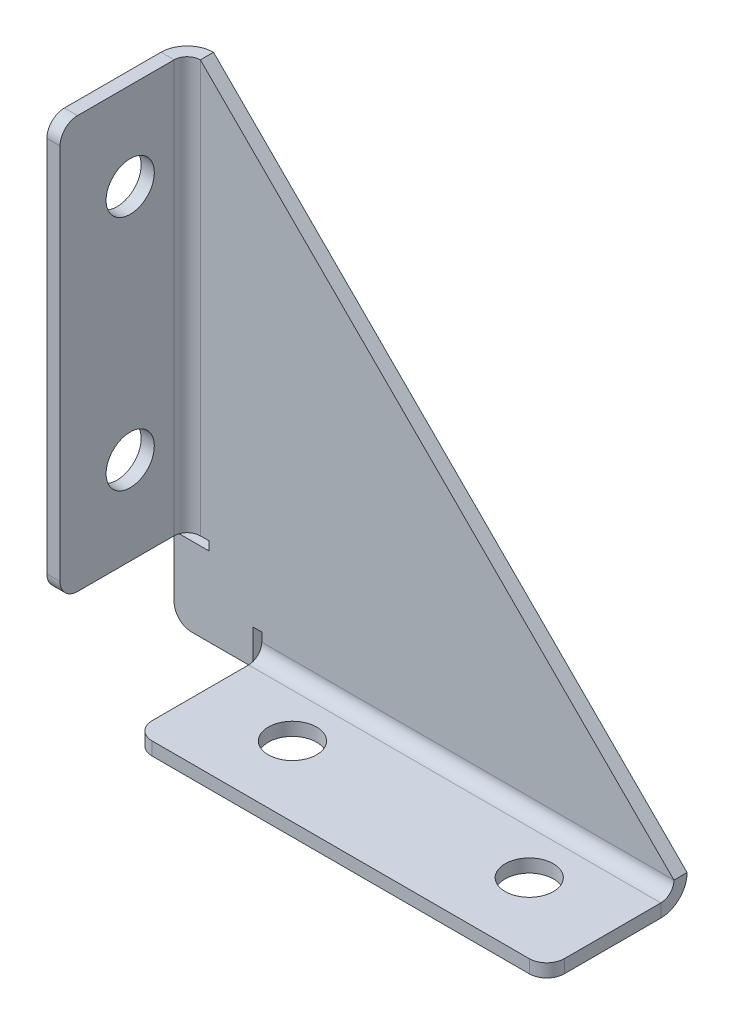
ISO-10303-21;
HEADER;
FILE_DESCRIPTION(('STEP AP214'),'2;1');
FILE_NAME('part.step','',(''),(''),'','','');
FILE_SCHEMA(('AUTOMOTIVE_DESIGN { 1 0 10303 214 1 1 1 1 }'));
ENDSEC;
DATA;
#1=APPLICATION_CONTEXT('core data for automotive mechanical design processes');
#2=APPLICATION_PROTOCOL_DEFINITION('international standard','automotive_design',2000,#1);
#3=PRODUCT_CONTEXT('',#1,'mechanical');
#4=PRODUCT('Part','Part','',(#3));
#5=PRODUCT_RELATED_PRODUCT_CATEGORY('part','',(#4));
#6=PRODUCT_DEFINITION_FORMATION('','',#4);
#7=PRODUCT_DEFINITION_CONTEXT('part definition',#1,'design');
#8=PRODUCT_DEFINITION('design','',#6,#7);
#9=PRODUCT_DEFINITION_SHAPE('','',#8);
#10=(LENGTH_UNIT() NAMED_UNIT(*) SI_UNIT(.MILLI.,.METRE.));
#11=(NAMED_UNIT(*) PLANE_ANGLE_UNIT() SI_UNIT($,.RADIAN.));
#12=(NAMED_UNIT(*) SI_UNIT($,.STERADIAN.) SOLID_ANGLE_UNIT());
#13=UNCERTAINTY_MEASURE_WITH_UNIT(LENGTH_MEASURE(1.E-05),#10,'distance_accuracy_value','');
#14=(GEOMETRIC_REPRESENTATION_CONTEXT(3) GLOBAL_UNCERTAINTY_ASSIGNED_CONTEXT((#13)) GLOBAL_UNIT_ASSIGNED_CONTEXT((#10,
#11,#12)) REPRESENTATION_CONTEXT('',''));
#15=CARTESIAN_POINT('',(0.,0.,0.));
#16=DIRECTION('',(0.,0.,1.));
#17=DIRECTION('',(1.,0.,0.));
#18=AXIS2_PLACEMENT_3D('',#15,#16,#17);
#19=CARTESIAN_POINT('',(47.,-1.80411241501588E-13,8.00000000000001));
#20=DIRECTION('',(0.,1.,0.));
#21=DIRECTION('',(0.,0.,1.));
#22=AXIS2_PLACEMENT_3D('',#19,#20,#21);
#23=CYLINDRICAL_SURFACE('',#22,2.75);
#24=CARTESIAN_POINT('',(47.,-1.80411241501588E-13,8.00000000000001));
#25=DIRECTION('',(0.,1.,0.));
#26=DIRECTION('',(0.,0.,1.));
#27=AXIS2_PLACEMENT_3D('',#24,#25,#26);
#28=CIRCLE('',#27,2.75);
#29=CARTESIAN_POINT('',(47.,-1.79636973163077E-13,10.75));
#30=VERTEX_POINT('',#29);
#31=EDGE_CURVE('E265',#30,#30,#28,.T.);
#32=ORIENTED_EDGE('',*,*,#31,.F.);
#33=EDGE_LOOP('',(#32));
#34=FACE_BOUND('',#33,.T.);
#35=CARTESIAN_POINT('',(47.,1.49999999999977,8.00000000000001));
#36=DIRECTION('',(0.,1.,0.));
#37=DIRECTION('',(0.,0.,1.));
#38=AXIS2_PLACEMENT_3D('',#35,#36,#37);
#39=CIRCLE('',#38,2.75);
#40=CARTESIAN_POINT('',(47.,1.49999999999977,10.75));
#41=VERTEX_POINT('',#40);
#42=EDGE_CURVE('E257',#41,#41,#39,.T.);
#43=ORIENTED_EDGE('',*,*,#42,.T.);
#44=EDGE_LOOP('',(#43));
#45=FACE_BOUND('',#44,.T.);
#46=ADVANCED_FACE('F28',(#34,#45),#23,.F.);
#47=CARTESIAN_POINT('',(0.,0.,1.50000000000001));
#48=DIRECTION('',(0.,1.,0.));
#49=DIRECTION('',(0.,0.,1.));
#50=AXIS2_PLACEMENT_3D('',#47,#48,#49);
#51=PLANE('',#50);
#52=CARTESIAN_POINT('',(20.,0.,8.00000000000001));
#53=DIRECTION('',(0.,1.,0.));
#54=DIRECTION('',(0.,0.,1.));
#55=AXIS2_PLACEMENT_3D('',#52,#53,#54);
#56=CIRCLE('',#55,2.75);
#57=CARTESIAN_POINT('',(20.,0.,10.75));
#58=VERTEX_POINT('',#57);
#59=EDGE_CURVE('E262',#58,#58,#56,.T.);
#60=ORIENTED_EDGE('',*,*,#59,.T.);
#61=EDGE_LOOP('',(#60));
#62=FACE_BOUND('',#61,.T.);
#63=ORIENTED_EDGE('',*,*,#31,.T.);
#64=EDGE_LOOP('',(#63));
#65=FACE_BOUND('',#64,.T.);
#66=DIRECTION('',(0.,0.,-1.));
#67=VECTOR('',#66,1.);
#68=CARTESIAN_POINT('',(10.,0.,16.));
#69=LINE('',#68,#67);
#70=CARTESIAN_POINT('',(10.,0.,14.));
#71=VERTEX_POINT('',#70);
#72=CARTESIAN_POINT('',(10.,0.,3.));
#73=VERTEX_POINT('',#72);
#74=EDGE_CURVE('E223',#71,#73,#69,.T.);
#75=ORIENTED_EDGE('',*,*,#74,.T.);
#76=DIRECTION('',(1.,0.,0.));
#77=VECTOR('',#76,1.);
#78=CARTESIAN_POINT('',(10.,0.,3.));
#79=LINE('',#78,#77);
#80=CARTESIAN_POINT('',(56.9999999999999,-1.90819582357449E-13,3.));
#81=VERTEX_POINT('',#80);
#82=EDGE_CURVE('E222',#73,#81,#79,.T.);
#83=ORIENTED_EDGE('',*,*,#82,.T.);
#84=DIRECTION('',(0.,0.,-1.));
#85=VECTOR('',#84,1.);
#86=CARTESIAN_POINT('',(57.,-1.90819582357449E-13,16.));
#87=LINE('',#86,#85);
#88=CARTESIAN_POINT('',(57.,-1.90819582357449E-13,14.));
#89=VERTEX_POINT('',#88);
#90=EDGE_CURVE('E11',#89,#81,#87,.T.);
#91=ORIENTED_EDGE('',*,*,#90,.F.);
#92=CARTESIAN_POINT('',(55.,-1.80411241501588E-13,14.));
#93=DIRECTION('',(0.,1.,0.));
#94=DIRECTION('',(0.,0.,1.));
#95=AXIS2_PLACEMENT_3D('',#92,#93,#94);
#96=CIRCLE('',#95,2.);
#97=CARTESIAN_POINT('',(55.,-1.80411241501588E-13,16.));
#98=VERTEX_POINT('',#97);
#99=EDGE_CURVE('E248',#89,#98,#96,.F.);
#100=ORIENTED_EDGE('',*,*,#99,.T.);
#101=DIRECTION('',(-1.,0.,0.));
#102=VECTOR('',#101,1.);
#103=CARTESIAN_POINT('',(57.,-1.90819582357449E-13,16.));
#104=LINE('',#103,#102);
#105=CARTESIAN_POINT('',(12.,0.,16.));
#106=VERTEX_POINT('',#105);
#107=EDGE_CURVE('E245',#98,#106,#104,.T.);
#108=ORIENTED_EDGE('',*,*,#107,.T.);
#109=CARTESIAN_POINT('',(12.,0.,14.));
#110=DIRECTION('',(0.,1.,0.));
#111=DIRECTION('',(0.,0.,1.));
#112=AXIS2_PLACEMENT_3D('',#109,#110,#111);
#113=CIRCLE('',#112,2.);
#114=EDGE_CURVE('E229',#106,#71,#113,.F.);
#115=ORIENTED_EDGE('',*,*,#114,.T.);
#116=EDGE_LOOP('',(#75,#83,#91,#100,#108,#115));
#117=FACE_BOUND('',#116,.T.);
#118=ADVANCED_FACE('F268',(#62,#65,#117),#51,.F.);
#119=CARTESIAN_POINT('',(20.,0.,8.00000000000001));
#120=DIRECTION('',(0.,1.,0.));
#121=DIRECTION('',(0.,0.,1.));
#122=AXIS2_PLACEMENT_3D('',#119,#120,#121);
#123=CYLINDRICAL_SURFACE('',#122,2.75);
#124=ORIENTED_EDGE('',*,*,#59,.F.);
#125=EDGE_LOOP('',(#124));
#126=FACE_BOUND('',#125,.T.);
#127=CARTESIAN_POINT('',(20.,1.49999999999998,8.00000000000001));
#128=DIRECTION('',(0.,1.,0.));
#129=DIRECTION('',(0.,0.,1.));
#130=AXIS2_PLACEMENT_3D('',#127,#128,#129);
#131=CIRCLE('',#130,2.75);
#132=CARTESIAN_POINT('',(20.,1.49999999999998,10.75));
#133=VERTEX_POINT('',#132);
#134=EDGE_CURVE('E463',#133,#133,#131,.T.);
#135=ORIENTED_EDGE('',*,*,#134,.T.);
#136=EDGE_LOOP('',(#135));
#137=FACE_BOUND('',#136,.T.);
#138=ADVANCED_FACE('F470',(#126,#137),#123,.F.);
#139=CARTESIAN_POINT('',(10.,1.49999999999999,16.));
#140=DIRECTION('',(0.,1.,0.));
#141=DIRECTION('',(0.,0.,1.));
#142=AXIS2_PLACEMENT_3D('',#139,#140,#141);
#143=PLANE('',#142);
#144=DIRECTION('',(1.,0.,0.));
#145=VECTOR('',#144,1.);
#146=CARTESIAN_POINT('',(10.,1.49999999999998,3.));
#147=LINE('',#146,#145);
#148=CARTESIAN_POINT('',(10.,1.49999999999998,3.));
#149=VERTEX_POINT('',#148);
#150=CARTESIAN_POINT('',(56.9999999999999,1.49999999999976,3.00000000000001));
#151=VERTEX_POINT('',#150);
#152=EDGE_CURVE('E206',#149,#151,#147,.T.);
#153=ORIENTED_EDGE('',*,*,#152,.F.);
#154=DIRECTION('',(0.,0.,-1.));
#155=VECTOR('',#154,1.);
#156=CARTESIAN_POINT('',(10.,1.49999999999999,16.));
#157=LINE('',#156,#155);
#158=CARTESIAN_POINT('',(10.,1.49999999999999,14.));
#159=VERTEX_POINT('',#158);
#160=EDGE_CURVE('E214',#159,#149,#157,.T.);
#161=ORIENTED_EDGE('',*,*,#160,.F.);
#162=CARTESIAN_POINT('',(12.,1.49999999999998,14.));
#163=DIRECTION('',(0.,1.,0.));
#164=DIRECTION('',(0.,0.,1.));
#165=AXIS2_PLACEMENT_3D('',#162,#163,#164);
#166=CIRCLE('',#165,2.);
#167=CARTESIAN_POINT('',(12.,1.49999999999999,16.));
#168=VERTEX_POINT('',#167);
#169=EDGE_CURVE('E43',#159,#168,#166,.T.);
#170=ORIENTED_EDGE('',*,*,#169,.T.);
#171=DIRECTION('',(1.,0.,0.));
#172=VECTOR('',#171,1.);
#173=CARTESIAN_POINT('',(10.,1.49999999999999,16.));
#174=LINE('',#173,#172);
#175=CARTESIAN_POINT('',(55.,1.49999999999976,16.));
#176=VERTEX_POINT('',#175);
#177=EDGE_CURVE('E51',#168,#176,#174,.T.);
#178=ORIENTED_EDGE('',*,*,#177,.T.);
#179=CARTESIAN_POINT('',(55.,1.49999999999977,14.));
#180=DIRECTION('',(0.,1.,0.));
#181=DIRECTION('',(0.,0.,1.));
#182=AXIS2_PLACEMENT_3D('',#179,#180,#181);
#183=CIRCLE('',#182,2.);
#184=CARTESIAN_POINT('',(57.,1.49999999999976,14.));
#185=VERTEX_POINT('',#184);
#186=EDGE_CURVE('E254',#176,#185,#183,.T.);
#187=ORIENTED_EDGE('',*,*,#186,.T.);
#188=DIRECTION('',(0.,0.,-1.));
#189=VECTOR('',#188,1.);
#190=CARTESIAN_POINT('',(57.,1.49999999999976,16.));
#191=LINE('',#190,#189);
#192=EDGE_CURVE('E216',#185,#151,#191,.T.);
#193=ORIENTED_EDGE('',*,*,#192,.T.);
#194=EDGE_LOOP('',(#153,#161,#170,#178,#187,#193));
#195=FACE_BOUND('',#194,.T.);
#196=ORIENTED_EDGE('',*,*,#134,.F.);
#197=EDGE_LOOP('',(#196));
#198=FACE_BOUND('',#197,.T.);
#199=ORIENTED_EDGE('',*,*,#42,.F.);
#200=EDGE_LOOP('',(#199));
#201=FACE_BOUND('',#200,.T.);
#202=ADVANCED_FACE('F219',(#195,#198,#201),#143,.T.);
#203=CARTESIAN_POINT('',(9.99999999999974,97.529482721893,16.));
#204=DIRECTION('',(-1.,0.,0.));
#205=DIRECTION('',(0.,1.,0.));
#206=AXIS2_PLACEMENT_3D('',#203,#204,#205);
#207=PLANE('',#206);
#208=ORIENTED_EDGE('',*,*,#74,.F.);
#209=DIRECTION('',(0.,-1.,0.));
#210=VECTOR('',#209,1.);
#211=CARTESIAN_POINT('',(9.99999999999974,97.529482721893,14.));
#212=LINE('',#211,#210);
#213=EDGE_CURVE('E201',#159,#71,#212,.T.);
#214=ORIENTED_EDGE('',*,*,#213,.F.);
#215=ORIENTED_EDGE('',*,*,#160,.T.);
#216=DIRECTION('',(0.,-1.,0.));
#217=VECTOR('',#216,1.);
#218=CARTESIAN_POINT('',(9.99999999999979,97.5294827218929,3.00000000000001));
#219=LINE('',#218,#217);
#220=EDGE_CURVE('E36',#149,#73,#219,.T.);
#221=ORIENTED_EDGE('',*,*,#220,.T.);
#222=EDGE_LOOP('',(#208,#214,#215,#221));
#223=FACE_BOUND('',#222,.T.);
#224=ADVANCED_FACE('F30',(#223),#207,.T.);
#225=CARTESIAN_POINT('',(11.9999999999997,97.529482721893,14.));
#226=DIRECTION('',(0.,-1.,0.));
#227=DIRECTION('',(0.,0.,-1.));
#228=AXIS2_PLACEMENT_3D('',#225,#226,#227);
#229=CYLINDRICAL_SURFACE('',#228,2.);
#230=ORIENTED_EDGE('',*,*,#213,.T.);
#231=ORIENTED_EDGE('',*,*,#114,.F.);
#232=DIRECTION('',(0.,-1.,0.));
#233=VECTOR('',#232,1.);
#234=CARTESIAN_POINT('',(11.9999999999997,97.529482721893,16.));
#235=LINE('',#234,#233);
#236=EDGE_CURVE('E240',#168,#106,#235,.T.);
#237=ORIENTED_EDGE('',*,*,#236,.F.);
#238=ORIENTED_EDGE('',*,*,#169,.F.);
#239=EDGE_LOOP('',(#230,#231,#237,#238));
#240=FACE_BOUND('',#239,.T.);
#241=ADVANCED_FACE('F243',(#240),#229,.T.);
#242=CARTESIAN_POINT('',(9.99999999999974,97.529482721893,16.));
#243=DIRECTION('',(0.,0.,-1.));
#244=DIRECTION('',(0.,1.,0.));
#245=AXIS2_PLACEMENT_3D('',#242,#243,#244);
#246=PLANE('',#245);
#247=ORIENTED_EDGE('',*,*,#236,.T.);
#248=ORIENTED_EDGE('',*,*,#107,.F.);
#249=DIRECTION('',(0.,-1.,0.));
#250=VECTOR('',#249,1.);
#251=CARTESIAN_POINT('',(54.9999999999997,97.5294827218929,16.));
#252=LINE('',#251,#250);
#253=EDGE_CURVE('E237',#176,#98,#252,.T.);
#254=ORIENTED_EDGE('',*,*,#253,.F.);
#255=ORIENTED_EDGE('',*,*,#177,.F.);
#256=EDGE_LOOP('',(#247,#248,#254,#255));
#257=FACE_BOUND('',#256,.T.);
#258=ADVANCED_FACE('F247',(#257),#246,.F.);
#259=CARTESIAN_POINT('',(54.9999999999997,97.5294827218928,14.));
#260=DIRECTION('',(0.,-1.,0.));
#261=DIRECTION('',(0.,0.,-1.));
#262=AXIS2_PLACEMENT_3D('',#259,#260,#261);
#263=CYLINDRICAL_SURFACE('',#262,2.);
#264=ORIENTED_EDGE('',*,*,#253,.T.);
#265=ORIENTED_EDGE('',*,*,#99,.F.);
#266=DIRECTION('',(0.,-1.,0.));
#267=VECTOR('',#266,1.);
#268=CARTESIAN_POINT('',(56.9999999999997,97.5294827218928,14.));
#269=LINE('',#268,#267);
#270=EDGE_CURVE('E234',#185,#89,#269,.T.);
#271=ORIENTED_EDGE('',*,*,#270,.F.);
#272=ORIENTED_EDGE('',*,*,#186,.F.);
#273=EDGE_LOOP('',(#264,#265,#271,#272));
#274=FACE_BOUND('',#273,.T.);
#275=ADVANCED_FACE('F252',(#274),#263,.T.);
#276=CARTESIAN_POINT('',(56.9999999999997,97.5294827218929,16.));
#277=DIRECTION('',(-1.,0.,0.));
#278=DIRECTION('',(0.,1.,0.));
#279=AXIS2_PLACEMENT_3D('',#276,#277,#278);
#280=PLANE('',#279);
#281=ORIENTED_EDGE('',*,*,#270,.T.);
#282=ORIENTED_EDGE('',*,*,#90,.T.);
#283=DIRECTION('',(0.,-1.,0.));
#284=VECTOR('',#283,1.);
#285=CARTESIAN_POINT('',(56.9999999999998,97.5294827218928,3.00000000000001));
#286=LINE('',#285,#284);
#287=EDGE_CURVE('E226',#151,#81,#286,.T.);
#288=ORIENTED_EDGE('',*,*,#287,.F.);
#289=ORIENTED_EDGE('',*,*,#192,.F.);
#290=EDGE_LOOP('',(#281,#282,#288,#289));
#291=FACE_BOUND('',#290,.T.);
#292=ADVANCED_FACE('F271',(#291),#280,.F.);
#293=CARTESIAN_POINT('',(-5.00000001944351E-05,47.,8.00000000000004));
#294=DIRECTION('',(1.,0.,0.));
#295=DIRECTION('',(0.,0.,-1.));
#296=AXIS2_PLACEMENT_3D('',#293,#294,#295);
#297=CYLINDRICAL_SURFACE('',#296,2.75);
#298=CARTESIAN_POINT('',(1.49999999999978,47.,8.00000000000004));
#299=DIRECTION('',(1.,0.,0.));
#300=DIRECTION('',(0.,0.,-1.));
#301=AXIS2_PLACEMENT_3D('',#298,#299,#300);
#302=CIRCLE('',#301,2.75);
#303=CARTESIAN_POINT('',(1.49999999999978,47.,5.25000000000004));
#304=VERTEX_POINT('',#303);
#305=EDGE_CURVE('E401',#304,#304,#302,.T.);
#306=ORIENTED_EDGE('',*,*,#305,.T.);
#307=EDGE_LOOP('',(#306));
#308=FACE_BOUND('',#307,.T.);
#309=CARTESIAN_POINT('',(-2.20752932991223E-13,47.,8.00000000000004));
#310=DIRECTION('',(1.,0.,0.));
#311=DIRECTION('',(0.,1.,0.));
#312=AXIS2_PLACEMENT_3D('',#309,#310,#311);
#313=CIRCLE('',#312,2.75);
#314=CARTESIAN_POINT('',(-2.27895279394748E-13,49.75,8.00000000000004));
#315=VERTEX_POINT('',#314);
#316=EDGE_CURVE('E420',#315,#315,#313,.T.);
#317=ORIENTED_EDGE('',*,*,#316,.F.);
#318=EDGE_LOOP('',(#317));
#319=FACE_BOUND('',#318,.T.);
#320=ADVANCED_FACE('F490',(#308,#319),#297,.F.);
#321=CARTESIAN_POINT('',(-2.20381677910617E-13,60.,1.49999999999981));
#322=DIRECTION('',(1.,0.,0.));
#323=DIRECTION('',(0.,1.,0.));
#324=AXIS2_PLACEMENT_3D('',#321,#322,#323);
#325=PLANE('',#324);
#326=CARTESIAN_POINT('',(0.,20.,8.00000000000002));
#327=DIRECTION('',(1.,0.,0.));
#328=DIRECTION('',(0.,1.,0.));
#329=AXIS2_PLACEMENT_3D('',#326,#327,#328);
#330=CIRCLE('',#329,2.75);
#331=CARTESIAN_POINT('',(0.,22.75,8.00000000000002));
#332=VERTEX_POINT('',#331);
#333=EDGE_CURVE('E417',#332,#332,#330,.T.);
#334=ORIENTED_EDGE('',*,*,#333,.T.);
#335=EDGE_LOOP('',(#334));
#336=FACE_BOUND('',#335,.T.);
#337=ORIENTED_EDGE('',*,*,#316,.T.);
#338=EDGE_LOOP('',(#337));
#339=FACE_BOUND('',#338,.T.);
#340=DIRECTION('',(0.,0.,-1.));
#341=VECTOR('',#340,1.);
#342=CARTESIAN_POINT('',(-2.20488217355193E-13,57.,15.9999999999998));
#343=LINE('',#342,#341);
#344=CARTESIAN_POINT('',(-2.20485007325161E-13,57.,13.9999999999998));
#345=VERTEX_POINT('',#344);
#346=CARTESIAN_POINT('',(-2.20467352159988E-13,57.,2.9999999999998));
#347=VERTEX_POINT('',#346);
#348=EDGE_CURVE('E435',#345,#347,#343,.T.);
#349=ORIENTED_EDGE('',*,*,#348,.T.);
#350=DIRECTION('',(0.,-1.,0.));
#351=VECTOR('',#350,1.);
#352=CARTESIAN_POINT('',(-2.20467352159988E-13,57.,2.9999999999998));
#353=LINE('',#352,#351);
#354=CARTESIAN_POINT('',(0.,10.,3.00000000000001));
#355=VERTEX_POINT('',#354);
#356=EDGE_CURVE('E443',#347,#355,#353,.T.);
#357=ORIENTED_EDGE('',*,*,#356,.T.);
#358=DIRECTION('',(0.,0.,-1.));
#359=VECTOR('',#358,1.);
#360=CARTESIAN_POINT('',(0.,10.,16.));
#361=LINE('',#360,#359);
#362=CARTESIAN_POINT('',(0.,10.,14.));
#363=VERTEX_POINT('',#362);
#364=EDGE_CURVE('E423',#363,#355,#361,.T.);
#365=ORIENTED_EDGE('',*,*,#364,.F.);
#366=CARTESIAN_POINT('',(0.,12.,14.));
#367=DIRECTION('',(1.,0.,0.));
#368=DIRECTION('',(0.,1.,0.));
#369=AXIS2_PLACEMENT_3D('',#366,#367,#368);
#370=CIRCLE('',#369,2.);
#371=CARTESIAN_POINT('',(0.,12.,16.));
#372=VERTEX_POINT('',#371);
#373=EDGE_CURVE('E426',#363,#372,#370,.F.);
#374=ORIENTED_EDGE('',*,*,#373,.T.);
#375=DIRECTION('',(0.,-1.,0.));
#376=VECTOR('',#375,1.);
#377=CARTESIAN_POINT('',(-2.20488217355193E-13,57.,15.9999999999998));
#378=LINE('',#377,#376);
#379=CARTESIAN_POINT('',(-2.20543728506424E-13,55.,15.9999999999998));
#380=VERTEX_POINT('',#379);
#381=EDGE_CURVE('E430',#380,#372,#378,.T.);
#382=ORIENTED_EDGE('',*,*,#381,.F.);
#383=CARTESIAN_POINT('',(-2.20540518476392E-13,55.,13.9999999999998));
#384=DIRECTION('',(1.,0.,0.));
#385=DIRECTION('',(0.,1.,0.));
#386=AXIS2_PLACEMENT_3D('',#383,#384,#385);
#387=CIRCLE('',#386,2.);
#388=EDGE_CURVE('E433',#380,#345,#387,.F.);
#389=ORIENTED_EDGE('',*,*,#388,.T.);
#390=EDGE_LOOP('',(#349,#357,#365,#374,#382,#389));
#391=FACE_BOUND('',#390,.T.);
#392=ADVANCED_FACE('F520',(#336,#339,#391),#325,.F.);
#393=CARTESIAN_POINT('',(-4.99999999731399E-05,20.,8.00000000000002));
#394=DIRECTION('',(1.,0.,0.));
#395=DIRECTION('',(0.,0.,-1.));
#396=AXIS2_PLACEMENT_3D('',#393,#394,#395);
#397=CYLINDRICAL_SURFACE('',#396,2.75);
#398=CARTESIAN_POINT('',(1.5,20.,8.00000000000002));
#399=DIRECTION('',(1.,0.,0.));
#400=DIRECTION('',(0.,0.,-1.));
#401=AXIS2_PLACEMENT_3D('',#398,#399,#400);
#402=CIRCLE('',#401,2.75);
#403=CARTESIAN_POINT('',(1.5,20.,5.25000000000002));
#404=VERTEX_POINT('',#403);
#405=EDGE_CURVE('E398',#404,#404,#402,.T.);
#406=ORIENTED_EDGE('',*,*,#405,.T.);
#407=EDGE_LOOP('',(#406));
#408=FACE_BOUND('',#407,.T.);
#409=ORIENTED_EDGE('',*,*,#333,.F.);
#410=EDGE_LOOP('',(#409));
#411=FACE_BOUND('',#410,.T.);
#412=ADVANCED_FACE('F529',(#408,#411),#397,.F.);
#413=CARTESIAN_POINT('',(1.5,10.,16.));
#414=DIRECTION('',(-1.,0.,0.));
#415=DIRECTION('',(0.,0.,1.));
#416=AXIS2_PLACEMENT_3D('',#413,#414,#415);
#417=PLANE('',#416);
#418=ORIENTED_EDGE('',*,*,#405,.F.);
#419=EDGE_LOOP('',(#418));
#420=FACE_BOUND('',#419,.T.);
#421=ORIENTED_EDGE('',*,*,#305,.F.);
#422=EDGE_LOOP('',(#421));
#423=FACE_BOUND('',#422,.T.);
#424=DIRECTION('',(0.,0.,-1.));
#425=VECTOR('',#424,1.);
#426=CARTESIAN_POINT('',(1.5,10.,16.));
#427=LINE('',#426,#425);
#428=CARTESIAN_POINT('',(1.5,10.,14.));
#429=VERTEX_POINT('',#428);
#430=CARTESIAN_POINT('',(1.5,10.,3.00000000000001));
#431=VERTEX_POINT('',#430);
#432=EDGE_CURVE('E409',#429,#431,#427,.T.);
#433=ORIENTED_EDGE('',*,*,#432,.T.);
#434=DIRECTION('',(0.,1.,0.));
#435=VECTOR('',#434,1.);
#436=CARTESIAN_POINT('',(1.49999999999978,57.,2.9999999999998));
#437=LINE('',#436,#435);
#438=CARTESIAN_POINT('',(1.49999999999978,57.,2.9999999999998));
#439=VERTEX_POINT('',#438);
#440=EDGE_CURVE('E438',#431,#439,#437,.T.);
#441=ORIENTED_EDGE('',*,*,#440,.T.);
#442=DIRECTION('',(0.,0.,-1.));
#443=VECTOR('',#442,1.);
#444=CARTESIAN_POINT('',(1.49999999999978,57.,15.9999999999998));
#445=LINE('',#444,#443);
#446=CARTESIAN_POINT('',(1.49999999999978,57.,13.9999999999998));
#447=VERTEX_POINT('',#446);
#448=EDGE_CURVE('E412',#447,#439,#445,.T.);
#449=ORIENTED_EDGE('',*,*,#448,.F.);
#450=CARTESIAN_POINT('',(1.49999999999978,55.,13.9999999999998));
#451=DIRECTION('',(-1.,0.,0.));
#452=DIRECTION('',(0.,0.,1.));
#453=AXIS2_PLACEMENT_3D('',#450,#451,#452);
#454=CIRCLE('',#453,2.);
#455=CARTESIAN_POINT('',(1.49999999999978,55.,15.9999999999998));
#456=VERTEX_POINT('',#455);
#457=EDGE_CURVE('E415',#447,#456,#454,.F.);
#458=ORIENTED_EDGE('',*,*,#457,.T.);
#459=DIRECTION('',(0.,1.,0.));
#460=VECTOR('',#459,1.);
#461=CARTESIAN_POINT('',(1.5,10.,16.));
#462=LINE('',#461,#460);
#463=CARTESIAN_POINT('',(1.5,12.,16.));
#464=VERTEX_POINT('',#463);
#465=EDGE_CURVE('E404',#464,#456,#462,.T.);
#466=ORIENTED_EDGE('',*,*,#465,.F.);
#467=CARTESIAN_POINT('',(1.5,12.,14.));
#468=DIRECTION('',(-1.,0.,0.));
#469=DIRECTION('',(0.,0.,1.));
#470=AXIS2_PLACEMENT_3D('',#467,#468,#469);
#471=CIRCLE('',#470,2.);
#472=EDGE_CURVE('E407',#464,#429,#471,.F.);
#473=ORIENTED_EDGE('',*,*,#472,.T.);
#474=EDGE_LOOP('',(#433,#441,#449,#458,#466,#473));
#475=FACE_BOUND('',#474,.T.);
#476=ADVANCED_FACE('F491',(#420,#423,#475),#417,.F.);
#477=CARTESIAN_POINT('',(97.5294827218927,56.9999999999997,15.9999999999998));
#478=DIRECTION('',(0.,1.,0.));
#479=DIRECTION('',(1.,0.,0.));
#480=AXIS2_PLACEMENT_3D('',#477,#478,#479);
#481=PLANE('',#480);
#482=ORIENTED_EDGE('',*,*,#348,.F.);
#483=DIRECTION('',(-1.,0.,0.));
#484=VECTOR('',#483,1.);
#485=CARTESIAN_POINT('',(97.5294827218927,56.9999999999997,13.9999999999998));
#486=LINE('',#485,#484);
#487=EDGE_CURVE('E457',#447,#345,#486,.T.);
#488=ORIENTED_EDGE('',*,*,#487,.F.);
#489=ORIENTED_EDGE('',*,*,#448,.T.);
#490=DIRECTION('',(-1.,0.,0.));
#491=VECTOR('',#490,1.);
#492=CARTESIAN_POINT('',(97.5294827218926,56.9999999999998,2.99999999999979));
#493=LINE('',#492,#491);
#494=EDGE_CURVE('E460',#439,#347,#493,.T.);
#495=ORIENTED_EDGE('',*,*,#494,.T.);
#496=EDGE_LOOP('',(#482,#488,#489,#495));
#497=FACE_BOUND('',#496,.T.);
#498=ADVANCED_FACE('F479',(#497),#481,.T.);
#499=CARTESIAN_POINT('',(97.5294827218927,54.9999999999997,13.9999999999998));
#500=DIRECTION('',(-1.,0.,0.));
#501=DIRECTION('',(0.,0.,1.));
#502=AXIS2_PLACEMENT_3D('',#499,#500,#501);
#503=CYLINDRICAL_SURFACE('',#502,2.);
#504=ORIENTED_EDGE('',*,*,#487,.T.);
#505=ORIENTED_EDGE('',*,*,#388,.F.);
#506=DIRECTION('',(-1.,0.,0.));
#507=VECTOR('',#506,1.);
#508=CARTESIAN_POINT('',(97.5294827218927,54.9999999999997,15.9999999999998));
#509=LINE('',#508,#507);
#510=EDGE_CURVE('E454',#456,#380,#509,.T.);
#511=ORIENTED_EDGE('',*,*,#510,.F.);
#512=ORIENTED_EDGE('',*,*,#457,.F.);
#513=EDGE_LOOP('',(#504,#505,#511,#512));
#514=FACE_BOUND('',#513,.T.);
#515=ADVANCED_FACE('F552',(#514),#503,.T.);
#516=CARTESIAN_POINT('',(97.5294827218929,9.99999999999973,16.));
#517=DIRECTION('',(0.,0.,1.));
#518=DIRECTION('',(1.,0.,0.));
#519=AXIS2_PLACEMENT_3D('',#516,#517,#518);
#520=PLANE('',#519);
#521=ORIENTED_EDGE('',*,*,#381,.T.);
#522=DIRECTION('',(-1.,0.,0.));
#523=VECTOR('',#522,1.);
#524=CARTESIAN_POINT('',(97.5294827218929,11.9999999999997,16.));
#525=LINE('',#524,#523);
#526=EDGE_CURVE('E451',#464,#372,#525,.T.);
#527=ORIENTED_EDGE('',*,*,#526,.F.);
#528=ORIENTED_EDGE('',*,*,#465,.T.);
#529=ORIENTED_EDGE('',*,*,#510,.T.);
#530=EDGE_LOOP('',(#521,#527,#528,#529));
#531=FACE_BOUND('',#530,.T.);
#532=ADVANCED_FACE('F559',(#531),#520,.T.);
#533=CARTESIAN_POINT('',(97.5294827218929,11.9999999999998,14.));
#534=DIRECTION('',(-1.,0.,0.));
#535=DIRECTION('',(0.,0.,1.));
#536=AXIS2_PLACEMENT_3D('',#533,#534,#535);
#537=CYLINDRICAL_SURFACE('',#536,2.);
#538=ORIENTED_EDGE('',*,*,#526,.T.);
#539=ORIENTED_EDGE('',*,*,#373,.F.);
#540=DIRECTION('',(-1.,0.,0.));
#541=VECTOR('',#540,1.);
#542=CARTESIAN_POINT('',(97.5294827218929,9.99999999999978,14.));
#543=LINE('',#542,#541);
#544=EDGE_CURVE('E448',#429,#363,#543,.T.);
#545=ORIENTED_EDGE('',*,*,#544,.F.);
#546=ORIENTED_EDGE('',*,*,#472,.F.);
#547=EDGE_LOOP('',(#538,#539,#545,#546));
#548=FACE_BOUND('',#547,.T.);
#549=ADVANCED_FACE('F566',(#548),#537,.T.);
#550=CARTESIAN_POINT('',(97.5294827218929,9.99999999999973,16.));
#551=DIRECTION('',(0.,1.,0.));
#552=DIRECTION('',(1.,0.,0.));
#553=AXIS2_PLACEMENT_3D('',#550,#551,#552);
#554=PLANE('',#553);
#555=ORIENTED_EDGE('',*,*,#544,.T.);
#556=ORIENTED_EDGE('',*,*,#364,.T.);
#557=DIRECTION('',(-1.,0.,0.));
#558=VECTOR('',#557,1.);
#559=CARTESIAN_POINT('',(97.5294827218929,9.99999999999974,3.));
#560=LINE('',#559,#558);
#561=EDGE_CURVE('E446',#431,#355,#560,.T.);
#562=ORIENTED_EDGE('',*,*,#561,.F.);
#563=ORIENTED_EDGE('',*,*,#432,.F.);
#564=EDGE_LOOP('',(#555,#556,#562,#563));
#565=FACE_BOUND('',#564,.T.);
#566=ADVANCED_FACE('F574',(#565),#554,.F.);
#567=CARTESIAN_POINT('',(10.,0.,161.220346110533));
#568=DIRECTION('',(1.,0.,0.));
#569=DIRECTION('',(0.,0.,-1.));
#570=AXIS2_PLACEMENT_3D('',#567,#568,#569);
#571=PLANE('',#570);
#572=DIRECTION('',(0.,0.,-1.));
#573=VECTOR('',#572,1.);
#574=CARTESIAN_POINT('',(10.,3.99999999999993,161.220346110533));
#575=LINE('',#574,#573);
#576=CARTESIAN_POINT('',(10.,3.99999999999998,1.50000000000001));
#577=VERTEX_POINT('',#576);
#578=CARTESIAN_POINT('',(10.,3.99999999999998,0.));
#579=VERTEX_POINT('',#578);
#580=EDGE_CURVE('E365',#577,#579,#575,.T.);
#581=ORIENTED_EDGE('',*,*,#580,.T.);
#582=DIRECTION('',(0.,-1.,0.));
#583=VECTOR('',#582,1.);
#584=CARTESIAN_POINT('',(10.,0.,0.));
#585=LINE('',#584,#583);
#586=CARTESIAN_POINT('',(10.,2.99999999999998,0.));
#587=VERTEX_POINT('',#586);
#588=EDGE_CURVE('E297',#579,#587,#585,.T.);
#589=ORIENTED_EDGE('',*,*,#588,.T.);
#590=DIRECTION('',(0.,0.,-1.));
#591=VECTOR('',#590,1.);
#592=CARTESIAN_POINT('',(10.,2.99999999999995,161.220346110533));
#593=LINE('',#592,#591);
#594=CARTESIAN_POINT('',(10.,2.99999999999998,1.50000000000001));
#595=VERTEX_POINT('',#594);
#596=EDGE_CURVE('E396',#595,#587,#593,.T.);
#597=ORIENTED_EDGE('',*,*,#596,.F.);
#598=DIRECTION('',(0.,-1.,0.));
#599=VECTOR('',#598,1.);
#600=CARTESIAN_POINT('',(10.,0.,1.5));
#601=LINE('',#600,#599);
#602=EDGE_CURVE('E358',#577,#595,#601,.T.);
#603=ORIENTED_EDGE('',*,*,#602,.F.);
#604=EDGE_LOOP('',(#581,#589,#597,#603));
#605=FACE_BOUND('',#604,.T.);
#606=ADVANCED_FACE('F583',(#605),#571,.F.);
#607=CARTESIAN_POINT('',(59.9999999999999,-1.76941794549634E-13,161.220346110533));
#608=DIRECTION('',(-0.707106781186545,-0.707106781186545,0.));
#609=DIRECTION('',(0.70710678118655,-0.70710678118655,0.));
#610=AXIS2_PLACEMENT_3D('',#607,#608,#609);
#611=PLANE('',#610);
#612=DIRECTION('',(0.,0.,-1.));
#613=VECTOR('',#612,1.);
#614=CARTESIAN_POINT('',(56.9999999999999,2.99999999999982,161.220346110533));
#615=LINE('',#614,#613);
#616=CARTESIAN_POINT('',(57.,2.99999999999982,1.50000000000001));
#617=VERTEX_POINT('',#616);
#618=CARTESIAN_POINT('',(57.,2.99999999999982,0.));
#619=VERTEX_POINT('',#618);
#620=EDGE_CURVE('E394',#617,#619,#615,.T.);
#621=ORIENTED_EDGE('',*,*,#620,.T.);
#622=DIRECTION('',(-0.70710678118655,0.70710678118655,0.));
#623=VECTOR('',#622,1.);
#624=CARTESIAN_POINT('',(60.,-1.90819582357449E-13,0.));
#625=LINE('',#624,#623);
#626=CARTESIAN_POINT('',(2.99999999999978,57.,-1.87350135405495E-13));
#627=VERTEX_POINT('',#626);
#628=EDGE_CURVE('E323',#619,#627,#625,.T.);
#629=ORIENTED_EDGE('',*,*,#628,.T.);
#630=DIRECTION('',(0.,0.,-1.));
#631=VECTOR('',#630,1.);
#632=CARTESIAN_POINT('',(2.99999999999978,56.9999999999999,161.220346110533));
#633=LINE('',#632,#631);
#634=CARTESIAN_POINT('',(2.99999999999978,57.,1.49999999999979));
#635=VERTEX_POINT('',#634);
#636=EDGE_CURVE('E392',#635,#627,#633,.T.);
#637=ORIENTED_EDGE('',*,*,#636,.F.);
#638=DIRECTION('',(-0.70710678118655,0.70710678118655,0.));
#639=VECTOR('',#638,1.);
#640=CARTESIAN_POINT('',(60.,-1.90819582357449E-13,1.50000000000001));
#641=LINE('',#640,#639);
#642=EDGE_CURVE('E329',#617,#635,#641,.T.);
#643=ORIENTED_EDGE('',*,*,#642,.F.);
#644=EDGE_LOOP('',(#621,#629,#637,#643));
#645=FACE_BOUND('',#644,.T.);
#646=ADVANCED_FACE('F592',(#645),#611,.F.);
#647=CARTESIAN_POINT('',(0.,9.99999999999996,161.220346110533));
#648=DIRECTION('',(0.,1.,0.));
#649=DIRECTION('',(-1.,0.,0.));
#650=AXIS2_PLACEMENT_3D('',#647,#648,#649);
#651=PLANE('',#650);
#652=DIRECTION('',(0.,0.,-1.));
#653=VECTOR('',#652,1.);
#654=CARTESIAN_POINT('',(3.,9.99999999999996,161.220346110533));
#655=LINE('',#654,#653);
#656=CARTESIAN_POINT('',(3.,10.,1.5));
#657=VERTEX_POINT('',#656);
#658=CARTESIAN_POINT('',(3.,10.,0.));
#659=VERTEX_POINT('',#658);
#660=EDGE_CURVE('E389',#657,#659,#655,.T.);
#661=ORIENTED_EDGE('',*,*,#660,.T.);
#662=DIRECTION('',(1.,0.,0.));
#663=VECTOR('',#662,1.);
#664=CARTESIAN_POINT('',(0.,10.,0.));
#665=LINE('',#664,#663);
#666=CARTESIAN_POINT('',(4.,10.,0.));
#667=VERTEX_POINT('',#666);
#668=EDGE_CURVE('E320',#659,#667,#665,.T.);
#669=ORIENTED_EDGE('',*,*,#668,.T.);
#670=DIRECTION('',(0.,0.,-1.));
#671=VECTOR('',#670,1.);
#672=CARTESIAN_POINT('',(4.,9.99999999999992,161.220346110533));
#673=LINE('',#672,#671);
#674=CARTESIAN_POINT('',(4.,10.,1.5));
#675=VERTEX_POINT('',#674);
#676=EDGE_CURVE('E386',#675,#667,#673,.T.);
#677=ORIENTED_EDGE('',*,*,#676,.F.);
#678=DIRECTION('',(1.,0.,0.));
#679=VECTOR('',#678,1.);
#680=CARTESIAN_POINT('',(0.,10.,1.50000000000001));
#681=LINE('',#680,#679);
#682=EDGE_CURVE('E332',#657,#675,#681,.T.);
#683=ORIENTED_EDGE('',*,*,#682,.F.);
#684=EDGE_LOOP('',(#661,#669,#677,#683));
#685=FACE_BOUND('',#684,.T.);
#686=ADVANCED_FACE('F600',(#685),#651,.F.);
#687=CARTESIAN_POINT('',(3.99999999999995,0.,161.220346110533));
#688=DIRECTION('',(1.,0.,0.));
#689=DIRECTION('',(0.,1.,0.));
#690=AXIS2_PLACEMENT_3D('',#687,#688,#689);
#691=PLANE('',#690);
#692=ORIENTED_EDGE('',*,*,#676,.T.);
#693=DIRECTION('',(0.,-1.,0.));
#694=VECTOR('',#693,1.);
#695=CARTESIAN_POINT('',(4.,0.,0.));
#696=LINE('',#695,#694);
#697=CARTESIAN_POINT('',(4.,9.00000000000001,0.));
#698=VERTEX_POINT('',#697);
#699=EDGE_CURVE('E317',#667,#698,#696,.T.);
#700=ORIENTED_EDGE('',*,*,#699,.T.);
#701=DIRECTION('',(0.,0.,-1.));
#702=VECTOR('',#701,1.);
#703=CARTESIAN_POINT('',(3.99999999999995,8.99999999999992,161.220346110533));
#704=LINE('',#703,#702);
#705=CARTESIAN_POINT('',(4.,9.00000000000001,1.50000000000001));
#706=VERTEX_POINT('',#705);
#707=EDGE_CURVE('E383',#706,#698,#704,.T.);
#708=ORIENTED_EDGE('',*,*,#707,.F.);
#709=DIRECTION('',(0.,-1.,0.));
#710=VECTOR('',#709,1.);
#711=CARTESIAN_POINT('',(4.,0.,1.5));
#712=LINE('',#711,#710);
#713=EDGE_CURVE('E335',#675,#706,#712,.T.);
#714=ORIENTED_EDGE('',*,*,#713,.F.);
#715=EDGE_LOOP('',(#692,#700,#708,#714));
#716=FACE_BOUND('',#715,.T.);
#717=ADVANCED_FACE('F609',(#716),#691,.F.);
#718=CARTESIAN_POINT('',(0.,8.99999999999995,161.220346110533));
#719=DIRECTION('',(0.,-1.,0.));
#720=DIRECTION('',(1.,0.,0.));
#721=AXIS2_PLACEMENT_3D('',#718,#719,#720);
#722=PLANE('',#721);
#723=ORIENTED_EDGE('',*,*,#707,.T.);
#724=DIRECTION('',(-1.,0.,0.));
#725=VECTOR('',#724,1.);
#726=CARTESIAN_POINT('',(0.,9.00000000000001,0.));
#727=LINE('',#726,#725);
#728=CARTESIAN_POINT('',(0.,9.00000000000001,0.));
#729=VERTEX_POINT('',#728);
#730=EDGE_CURVE('E314',#698,#729,#727,.T.);
#731=ORIENTED_EDGE('',*,*,#730,.T.);
#732=DIRECTION('',(0.,0.,-1.));
#733=VECTOR('',#732,1.);
#734=CARTESIAN_POINT('',(0.,8.99999999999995,161.220346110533));
#735=LINE('',#734,#733);
#736=CARTESIAN_POINT('',(0.,9.00000000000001,1.50000000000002));
#737=VERTEX_POINT('',#736);
#738=EDGE_CURVE('E380',#737,#729,#735,.T.);
#739=ORIENTED_EDGE('',*,*,#738,.F.);
#740=DIRECTION('',(-1.,0.,0.));
#741=VECTOR('',#740,1.);
#742=CARTESIAN_POINT('',(0.,9.00000000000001,1.50000000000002));
#743=LINE('',#742,#741);
#744=EDGE_CURVE('E338',#706,#737,#743,.T.);
#745=ORIENTED_EDGE('',*,*,#744,.F.);
#746=EDGE_LOOP('',(#723,#731,#739,#745));
#747=FACE_BOUND('',#746,.T.);
#748=ADVANCED_FACE('F617',(#747),#722,.F.);
#749=CARTESIAN_POINT('',(-2.20638031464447E-13,59.9999999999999,161.220346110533));
#750=DIRECTION('',(1.,0.,0.));
#751=DIRECTION('',(0.,1.,0.));
#752=AXIS2_PLACEMENT_3D('',#749,#750,#751);
#753=PLANE('',#752);
#754=ORIENTED_EDGE('',*,*,#738,.T.);
#755=DIRECTION('',(0.,-1.,0.));
#756=VECTOR('',#755,1.);
#757=CARTESIAN_POINT('',(-2.20379270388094E-13,60.,-2.1163626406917E-13));
#758=LINE('',#757,#756);
#759=CARTESIAN_POINT('',(0.,2.,0.));
#760=VERTEX_POINT('',#759);
#761=EDGE_CURVE('E311',#729,#760,#758,.T.);
#762=ORIENTED_EDGE('',*,*,#761,.T.);
#763=DIRECTION('',(0.,0.,-1.));
#764=VECTOR('',#763,1.);
#765=CARTESIAN_POINT('',(0.,1.99999999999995,161.220346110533));
#766=LINE('',#765,#764);
#767=CARTESIAN_POINT('',(0.,2.,1.50000000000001));
#768=VERTEX_POINT('',#767);
#769=EDGE_CURVE('E377',#768,#760,#766,.T.);
#770=ORIENTED_EDGE('',*,*,#769,.F.);
#771=DIRECTION('',(0.,-1.,0.));
#772=VECTOR('',#771,1.);
#773=CARTESIAN_POINT('',(-2.20381677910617E-13,60.,1.49999999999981));
#774=LINE('',#773,#772);
#775=EDGE_CURVE('E341',#737,#768,#774,.T.);
#776=ORIENTED_EDGE('',*,*,#775,.F.);
#777=EDGE_LOOP('',(#754,#762,#770,#776));
#778=FACE_BOUND('',#777,.T.);
#779=ADVANCED_FACE('F625',(#778),#753,.F.);
#780=CARTESIAN_POINT('',(2.,1.99999999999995,161.220346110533));
#781=DIRECTION('',(0.,0.,-1.));
#782=DIRECTION('',(-1.,0.,0.));
#783=AXIS2_PLACEMENT_3D('',#780,#781,#782);
#784=CYLINDRICAL_SURFACE('',#783,2.);
#785=ORIENTED_EDGE('',*,*,#769,.T.);
#786=CARTESIAN_POINT('',(2.,2.,0.));
#787=DIRECTION('',(0.,0.,1.));
#788=DIRECTION('',(1.,0.,0.));
#789=AXIS2_PLACEMENT_3D('',#786,#787,#788);
#790=CIRCLE('',#789,2.);
#791=CARTESIAN_POINT('',(2.,0.,0.));
#792=VERTEX_POINT('',#791);
#793=EDGE_CURVE('E301',#792,#760,#790,.F.);
#794=ORIENTED_EDGE('',*,*,#793,.F.);
#795=DIRECTION('',(0.,0.,-1.));
#796=VECTOR('',#795,1.);
#797=CARTESIAN_POINT('',(2.,0.,161.220346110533));
#798=LINE('',#797,#796);
#799=CARTESIAN_POINT('',(2.,0.,1.50000000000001));
#800=VERTEX_POINT('',#799);
#801=EDGE_CURVE('E374',#800,#792,#798,.T.);
#802=ORIENTED_EDGE('',*,*,#801,.F.);
#803=CARTESIAN_POINT('',(2.,2.,1.50000000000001));
#804=DIRECTION('',(0.,0.,1.));
#805=DIRECTION('',(1.,0.,0.));
#806=AXIS2_PLACEMENT_3D('',#803,#804,#805);
#807=CIRCLE('',#806,2.);
#808=EDGE_CURVE('E344',#768,#800,#807,.T.);
#809=ORIENTED_EDGE('',*,*,#808,.F.);
#810=EDGE_LOOP('',(#785,#794,#802,#809));
#811=FACE_BOUND('',#810,.T.);
#812=ADVANCED_FACE('F634',(#811),#784,.T.);
#813=CARTESIAN_POINT('',(0.,0.,161.220346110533));
#814=DIRECTION('',(0.,1.,0.));
#815=DIRECTION('',(0.,0.,1.));
#816=AXIS2_PLACEMENT_3D('',#813,#814,#815);
#817=PLANE('',#816);
#818=ORIENTED_EDGE('',*,*,#801,.T.);
#819=DIRECTION('',(1.,0.,0.));
#820=VECTOR('',#819,1.);
#821=CARTESIAN_POINT('',(0.,0.,0.));
#822=LINE('',#821,#820);
#823=CARTESIAN_POINT('',(9.00000000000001,0.,0.));
#824=VERTEX_POINT('',#823);
#825=EDGE_CURVE('E298',#792,#824,#822,.T.);
#826=ORIENTED_EDGE('',*,*,#825,.T.);
#827=DIRECTION('',(0.,0.,-1.));
#828=VECTOR('',#827,1.);
#829=CARTESIAN_POINT('',(9.00000000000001,0.,161.220346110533));
#830=LINE('',#829,#828);
#831=CARTESIAN_POINT('',(9.00000000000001,0.,1.5));
#832=VERTEX_POINT('',#831);
#833=EDGE_CURVE('E371',#832,#824,#830,.T.);
#834=ORIENTED_EDGE('',*,*,#833,.F.);
#835=DIRECTION('',(1.,0.,0.));
#836=VECTOR('',#835,1.);
#837=CARTESIAN_POINT('',(0.,0.,1.50000000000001));
#838=LINE('',#837,#836);
#839=EDGE_CURVE('E349',#800,#832,#838,.T.);
#840=ORIENTED_EDGE('',*,*,#839,.F.);
#841=EDGE_LOOP('',(#818,#826,#834,#840));
#842=FACE_BOUND('',#841,.T.);
#843=ADVANCED_FACE('F642',(#842),#817,.F.);
#844=CARTESIAN_POINT('',(9.00000000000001,0.,161.220346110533));
#845=DIRECTION('',(-1.,0.,0.));
#846=DIRECTION('',(0.,0.,1.));
#847=AXIS2_PLACEMENT_3D('',#844,#845,#846);
#848=PLANE('',#847);
#849=ORIENTED_EDGE('',*,*,#833,.T.);
#850=DIRECTION('',(0.,1.,0.));
#851=VECTOR('',#850,1.);
#852=CARTESIAN_POINT('',(9.00000000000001,0.,0.));
#853=LINE('',#852,#851);
#854=CARTESIAN_POINT('',(9.00000000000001,3.99999999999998,0.));
#855=VERTEX_POINT('',#854);
#856=EDGE_CURVE('E302',#824,#855,#853,.T.);
#857=ORIENTED_EDGE('',*,*,#856,.T.);
#858=DIRECTION('',(0.,0.,-1.));
#859=VECTOR('',#858,1.);
#860=CARTESIAN_POINT('',(9.00000000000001,3.99999999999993,161.220346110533));
#861=LINE('',#860,#859);
#862=CARTESIAN_POINT('',(9.00000000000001,3.99999999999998,1.50000000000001));
#863=VERTEX_POINT('',#862);
#864=EDGE_CURVE('E368',#863,#855,#861,.T.);
#865=ORIENTED_EDGE('',*,*,#864,.F.);
#866=DIRECTION('',(0.,1.,0.));
#867=VECTOR('',#866,1.);
#868=CARTESIAN_POINT('',(9.00000000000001,0.,1.5));
#869=LINE('',#868,#867);
#870=EDGE_CURVE('E352',#832,#863,#869,.T.);
#871=ORIENTED_EDGE('',*,*,#870,.F.);
#872=EDGE_LOOP('',(#849,#857,#865,#871));
#873=FACE_BOUND('',#872,.T.);
#874=ADVANCED_FACE('F651',(#873),#848,.F.);
#875=CARTESIAN_POINT('',(0.,3.99999999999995,161.220346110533));
#876=DIRECTION('',(0.,1.,0.));
#877=DIRECTION('',(0.,0.,1.));
#878=AXIS2_PLACEMENT_3D('',#875,#876,#877);
#879=PLANE('',#878);
#880=ORIENTED_EDGE('',*,*,#864,.T.);
#881=DIRECTION('',(1.,0.,0.));
#882=VECTOR('',#881,1.);
#883=CARTESIAN_POINT('',(0.,4.,0.));
#884=LINE('',#883,#882);
#885=EDGE_CURVE('E305',#855,#579,#884,.T.);
#886=ORIENTED_EDGE('',*,*,#885,.T.);
#887=ORIENTED_EDGE('',*,*,#580,.F.);
#888=DIRECTION('',(1.,0.,0.));
#889=VECTOR('',#888,1.);
#890=CARTESIAN_POINT('',(0.,4.,1.50000000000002));
#891=LINE('',#890,#889);
#892=EDGE_CURVE('E355',#863,#577,#891,.T.);
#893=ORIENTED_EDGE('',*,*,#892,.F.);
#894=EDGE_LOOP('',(#880,#886,#887,#893));
#895=FACE_BOUND('',#894,.T.);
#896=ADVANCED_FACE('F659',(#895),#879,.F.);
#897=CARTESIAN_POINT('',(0.,0.,1.50000000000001));
#898=DIRECTION('',(0.,0.,1.));
#899=DIRECTION('',(1.,0.,0.));
#900=AXIS2_PLACEMENT_3D('',#897,#898,#899);
#901=PLANE('',#900);
#902=ORIENTED_EDGE('',*,*,#602,.T.);
#903=DIRECTION('',(1.,0.,0.));
#904=VECTOR('',#903,1.);
#905=CARTESIAN_POINT('',(10.,2.99999999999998,1.50000000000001));
#906=LINE('',#905,#904);
#907=EDGE_CURVE('E209',#595,#617,#906,.T.);
#908=ORIENTED_EDGE('',*,*,#907,.T.);
#909=ORIENTED_EDGE('',*,*,#642,.T.);
#910=DIRECTION('',(0.,-1.,0.));
#911=VECTOR('',#910,1.);
#912=CARTESIAN_POINT('',(2.99999999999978,57.,1.49999999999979));
#913=LINE('',#912,#911);
#914=EDGE_CURVE('E361',#635,#657,#913,.T.);
#915=ORIENTED_EDGE('',*,*,#914,.T.);
#916=ORIENTED_EDGE('',*,*,#682,.T.);
#917=ORIENTED_EDGE('',*,*,#713,.T.);
#918=ORIENTED_EDGE('',*,*,#744,.T.);
#919=ORIENTED_EDGE('',*,*,#775,.T.);
#920=ORIENTED_EDGE('',*,*,#808,.T.);
#921=ORIENTED_EDGE('',*,*,#839,.T.);
#922=ORIENTED_EDGE('',*,*,#870,.T.);
#923=ORIENTED_EDGE('',*,*,#892,.T.);
#924=EDGE_LOOP('',(#902,#908,#909,#915,#916,#917,#918,#919,#920,#921,#922,#923));
#925=FACE_BOUND('',#924,.T.);
#926=ADVANCED_FACE('F667',(#925),#901,.T.);
#927=CARTESIAN_POINT('',(0.,0.,0.));
#928=DIRECTION('',(0.,0.,1.));
#929=DIRECTION('',(1.,0.,0.));
#930=AXIS2_PLACEMENT_3D('',#927,#928,#929);
#931=PLANE('',#930);
#932=DIRECTION('',(1.,0.,0.));
#933=VECTOR('',#932,1.);
#934=CARTESIAN_POINT('',(10.,2.99999999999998,0.));
#935=LINE('',#934,#933);
#936=EDGE_CURVE('E281',#587,#619,#935,.T.);
#937=ORIENTED_EDGE('',*,*,#936,.F.);
#938=ORIENTED_EDGE('',*,*,#588,.F.);
#939=ORIENTED_EDGE('',*,*,#885,.F.);
#940=ORIENTED_EDGE('',*,*,#856,.F.);
#941=ORIENTED_EDGE('',*,*,#825,.F.);
#942=ORIENTED_EDGE('',*,*,#793,.T.);
#943=ORIENTED_EDGE('',*,*,#761,.F.);
#944=ORIENTED_EDGE('',*,*,#730,.F.);
#945=ORIENTED_EDGE('',*,*,#699,.F.);
#946=ORIENTED_EDGE('',*,*,#668,.F.);
#947=DIRECTION('',(0.,-1.,0.));
#948=VECTOR('',#947,1.);
#949=CARTESIAN_POINT('',(2.99999999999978,57.,-1.87350135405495E-13));
#950=LINE('',#949,#948);
#951=EDGE_CURVE('E326',#627,#659,#950,.T.);
#952=ORIENTED_EDGE('',*,*,#951,.F.);
#953=ORIENTED_EDGE('',*,*,#628,.F.);
#954=EDGE_LOOP('',(#937,#938,#939,#940,#941,#942,#943,#944,#945,#946,#952,#953));
#955=FACE_BOUND('',#954,.T.);
#956=ADVANCED_FACE('F675',(#955),#931,.F.);
#957=CARTESIAN_POINT('',(3.,10.,3.));
#958=DIRECTION('',(0.,-1.,0.));
#959=DIRECTION('',(1.,0.,0.));
#960=AXIS2_PLACEMENT_3D('',#957,#958,#959);
#961=PLANE('',#960);
#962=ORIENTED_EDGE('',*,*,#660,.F.);
#963=CARTESIAN_POINT('',(3.,10.,3.));
#964=DIRECTION('',(0.,-1.,0.));
#965=DIRECTION('',(0.,0.,-1.));
#966=AXIS2_PLACEMENT_3D('',#963,#964,#965);
#967=CIRCLE('',#966,1.5);
#968=EDGE_CURVE('E284',#657,#431,#967,.F.);
#969=ORIENTED_EDGE('',*,*,#968,.T.);
#970=ORIENTED_EDGE('',*,*,#561,.T.);
#971=CARTESIAN_POINT('',(3.,10.,3.));
#972=DIRECTION('',(0.,-1.,0.));
#973=DIRECTION('',(0.,0.,-1.));
#974=AXIS2_PLACEMENT_3D('',#971,#972,#973);
#975=CIRCLE('',#974,3.);
#976=EDGE_CURVE('E294',#659,#355,#975,.F.);
#977=ORIENTED_EDGE('',*,*,#976,.F.);
#978=EDGE_LOOP('',(#962,#969,#970,#977));
#979=FACE_BOUND('',#978,.T.);
#980=ADVANCED_FACE('F683',(#979),#961,.T.);
#981=CARTESIAN_POINT('',(2.99999999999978,57.,2.99999999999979));
#982=DIRECTION('',(0.,1.,0.));
#983=DIRECTION('',(0.,0.,1.));
#984=AXIS2_PLACEMENT_3D('',#981,#982,#983);
#985=PLANE('',#984);
#986=ORIENTED_EDGE('',*,*,#494,.F.);
#987=CARTESIAN_POINT('',(2.99999999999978,57.,2.99999999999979));
#988=DIRECTION('',(0.,-1.,0.));
#989=DIRECTION('',(0.,0.,-1.));
#990=AXIS2_PLACEMENT_3D('',#987,#988,#989);
#991=CIRCLE('',#990,1.5);
#992=EDGE_CURVE('E282',#439,#635,#991,.T.);
#993=ORIENTED_EDGE('',*,*,#992,.T.);
#994=ORIENTED_EDGE('',*,*,#636,.T.);
#995=CARTESIAN_POINT('',(2.99999999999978,57.,2.99999999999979));
#996=DIRECTION('',(0.,-1.,0.));
#997=DIRECTION('',(0.,0.,-1.));
#998=AXIS2_PLACEMENT_3D('',#995,#996,#997);
#999=CIRCLE('',#998,3.);
#1000=EDGE_CURVE('E291',#347,#627,#999,.T.);
#1001=ORIENTED_EDGE('',*,*,#1000,.F.);
#1002=EDGE_LOOP('',(#986,#993,#994,#1001));
#1003=FACE_BOUND('',#1002,.T.);
#1004=ADVANCED_FACE('F691',(#1003),#985,.T.);
#1005=CARTESIAN_POINT('',(2.99999999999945,156.761829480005,3.00000000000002));
#1006=DIRECTION('',(0.,-1.,0.));
#1007=DIRECTION('',(0.,0.,-1.));
#1008=AXIS2_PLACEMENT_3D('',#1005,#1006,#1007);
#1009=CYLINDRICAL_SURFACE('',#1008,3.);
#1010=ORIENTED_EDGE('',*,*,#1000,.T.);
#1011=ORIENTED_EDGE('',*,*,#951,.T.);
#1012=ORIENTED_EDGE('',*,*,#976,.T.);
#1013=ORIENTED_EDGE('',*,*,#356,.F.);
#1014=EDGE_LOOP('',(#1010,#1011,#1012,#1013));
#1015=FACE_BOUND('',#1014,.T.);
#1016=ADVANCED_FACE('F699',(#1015),#1009,.T.);
#1017=CARTESIAN_POINT('',(2.99999999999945,156.761829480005,3.00000000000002));
#1018=DIRECTION('',(0.,-1.,0.));
#1019=DIRECTION('',(0.,0.,-1.));
#1020=AXIS2_PLACEMENT_3D('',#1017,#1018,#1019);
#1021=CYLINDRICAL_SURFACE('',#1020,1.5);
#1022=ORIENTED_EDGE('',*,*,#992,.F.);
#1023=ORIENTED_EDGE('',*,*,#440,.F.);
#1024=ORIENTED_EDGE('',*,*,#968,.F.);
#1025=ORIENTED_EDGE('',*,*,#914,.F.);
#1026=EDGE_LOOP('',(#1022,#1023,#1024,#1025));
#1027=FACE_BOUND('',#1026,.T.);
#1028=ADVANCED_FACE('F707',(#1027),#1021,.F.);
#1029=CARTESIAN_POINT('',(56.9999999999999,2.99999999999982,3.00000000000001));
#1030=DIRECTION('',(1.,0.,0.));
#1031=DIRECTION('',(0.,0.,-1.));
#1032=AXIS2_PLACEMENT_3D('',#1029,#1030,#1031);
#1033=PLANE('',#1032);
#1034=ORIENTED_EDGE('',*,*,#620,.F.);
#1035=CARTESIAN_POINT('',(56.9999999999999,2.99999999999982,3.00000000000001));
#1036=DIRECTION('',(1.,0.,0.));
#1037=DIRECTION('',(0.,0.,-1.));
#1038=AXIS2_PLACEMENT_3D('',#1035,#1036,#1037);
#1039=CIRCLE('',#1038,1.5);
#1040=EDGE_CURVE('E211',#617,#151,#1039,.F.);
#1041=ORIENTED_EDGE('',*,*,#1040,.T.);
#1042=ORIENTED_EDGE('',*,*,#287,.T.);
#1043=CARTESIAN_POINT('',(56.9999999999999,2.99999999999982,3.00000000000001));
#1044=DIRECTION('',(1.,0.,0.));
#1045=DIRECTION('',(0.,0.,-1.));
#1046=AXIS2_PLACEMENT_3D('',#1043,#1044,#1045);
#1047=CIRCLE('',#1046,3.);
#1048=EDGE_CURVE('E276',#619,#81,#1047,.F.);
#1049=ORIENTED_EDGE('',*,*,#1048,.F.);
#1050=EDGE_LOOP('',(#1034,#1041,#1042,#1049));
#1051=FACE_BOUND('',#1050,.T.);
#1052=ADVANCED_FACE('F275',(#1051),#1033,.T.);
#1053=CARTESIAN_POINT('',(10.,2.99999999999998,3.));
#1054=DIRECTION('',(-1.,0.,0.));
#1055=DIRECTION('',(0.,0.,1.));
#1056=AXIS2_PLACEMENT_3D('',#1053,#1054,#1055);
#1057=PLANE('',#1056);
#1058=ORIENTED_EDGE('',*,*,#220,.F.);
#1059=CARTESIAN_POINT('',(10.,2.99999999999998,3.));
#1060=DIRECTION('',(1.,0.,0.));
#1061=DIRECTION('',(0.,0.,-1.));
#1062=AXIS2_PLACEMENT_3D('',#1059,#1060,#1061);
#1063=CIRCLE('',#1062,1.5);
#1064=EDGE_CURVE('E193',#149,#595,#1063,.T.);
#1065=ORIENTED_EDGE('',*,*,#1064,.T.);
#1066=ORIENTED_EDGE('',*,*,#596,.T.);
#1067=CARTESIAN_POINT('',(10.,2.99999999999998,3.));
#1068=DIRECTION('',(1.,0.,0.));
#1069=DIRECTION('',(0.,0.,-1.));
#1070=AXIS2_PLACEMENT_3D('',#1067,#1068,#1069);
#1071=CIRCLE('',#1070,3.);
#1072=EDGE_CURVE('E196',#73,#587,#1071,.T.);
#1073=ORIENTED_EDGE('',*,*,#1072,.F.);
#1074=EDGE_LOOP('',(#1058,#1065,#1066,#1073));
#1075=FACE_BOUND('',#1074,.T.);
#1076=ADVANCED_FACE('F192',(#1075),#1057,.T.);
#1077=CARTESIAN_POINT('',(-82.087384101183,3.00000000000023,3.00000000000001));
#1078=DIRECTION('',(1.,0.,0.));
#1079=DIRECTION('',(0.,0.,-1.));
#1080=AXIS2_PLACEMENT_3D('',#1077,#1078,#1079);
#1081=CYLINDRICAL_SURFACE('',#1080,3.);
#1082=ORIENTED_EDGE('',*,*,#1072,.T.);
#1083=ORIENTED_EDGE('',*,*,#936,.T.);
#1084=ORIENTED_EDGE('',*,*,#1048,.T.);
#1085=ORIENTED_EDGE('',*,*,#82,.F.);
#1086=EDGE_LOOP('',(#1082,#1083,#1084,#1085));
#1087=FACE_BOUND('',#1086,.T.);
#1088=ADVANCED_FACE('F279',(#1087),#1081,.T.);
#1089=CARTESIAN_POINT('',(-82.087384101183,3.00000000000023,3.00000000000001));
#1090=DIRECTION('',(1.,0.,0.));
#1091=DIRECTION('',(0.,0.,-1.));
#1092=AXIS2_PLACEMENT_3D('',#1089,#1090,#1091);
#1093=CYLINDRICAL_SURFACE('',#1092,1.5);
#1094=ORIENTED_EDGE('',*,*,#1064,.F.);
#1095=ORIENTED_EDGE('',*,*,#152,.T.);
#1096=ORIENTED_EDGE('',*,*,#1040,.F.);
#1097=ORIENTED_EDGE('',*,*,#907,.F.);
#1098=EDGE_LOOP('',(#1094,#1095,#1096,#1097));
#1099=FACE_BOUND('',#1098,.T.);
#1100=ADVANCED_FACE('F203',(#1099),#1093,.F.);
#1101=CLOSED_SHELL('',(#46,#118,#138,#202,#224,#241,#258,#275,#292,#320,#392,#412,#476,#498,
#515,#532,#549,#566,#606,#646,#686,#717,#748,#779,#812,#843,#874,#896,#926,#956,#980,#1004,
#1016,#1028,#1052,#1076,#1088,#1100));
#1102=MANIFOLD_SOLID_BREP('B2',#1101);
#1103=ADVANCED_BREP_SHAPE_REPRESENTATION('',(#18,#1102),#14);
#1104=SHAPE_DEFINITION_REPRESENTATION(#9,#1103);
ENDSEC;
END-ISO-10303-21;
